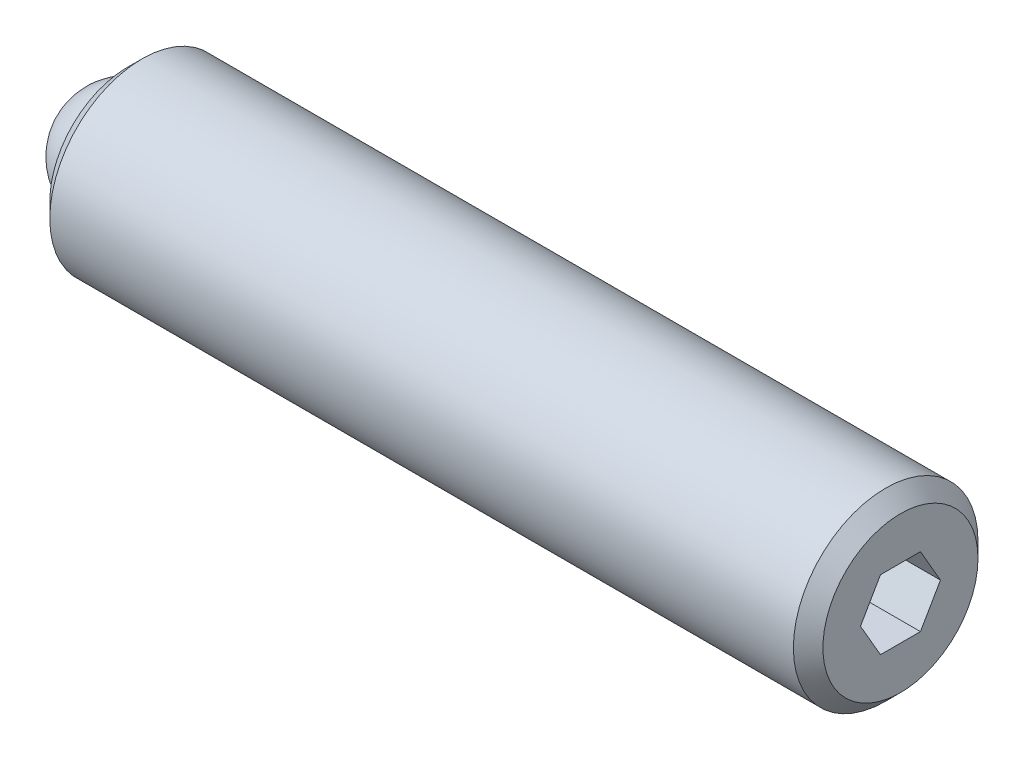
ISO-10303-21;
HEADER;
FILE_DESCRIPTION(('STEP AP214'),'2;1');
FILE_NAME('part.step','',(''),(''),'','','');
FILE_SCHEMA(('AUTOMOTIVE_DESIGN { 1 0 10303 214 1 1 1 1 }'));
ENDSEC;
DATA;
#1=APPLICATION_CONTEXT('core data for automotive mechanical design processes');
#2=APPLICATION_PROTOCOL_DEFINITION('international standard','automotive_design',2000,#1);
#3=PRODUCT_CONTEXT('',#1,'mechanical');
#4=PRODUCT('Part','Part','',(#3));
#5=PRODUCT_RELATED_PRODUCT_CATEGORY('part','',(#4));
#6=PRODUCT_DEFINITION_FORMATION('','',#4);
#7=PRODUCT_DEFINITION_CONTEXT('part definition',#1,'design');
#8=PRODUCT_DEFINITION('design','',#6,#7);
#9=PRODUCT_DEFINITION_SHAPE('','',#8);
#10=(LENGTH_UNIT() NAMED_UNIT(*) SI_UNIT(.MILLI.,.METRE.));
#11=(NAMED_UNIT(*) PLANE_ANGLE_UNIT() SI_UNIT($,.RADIAN.));
#12=(NAMED_UNIT(*) SI_UNIT($,.STERADIAN.) SOLID_ANGLE_UNIT());
#13=UNCERTAINTY_MEASURE_WITH_UNIT(LENGTH_MEASURE(1.E-05),#10,'distance_accuracy_value','');
#14=(GEOMETRIC_REPRESENTATION_CONTEXT(3) GLOBAL_UNCERTAINTY_ASSIGNED_CONTEXT((#13)) GLOBAL_UNIT_ASSIGNED_CONTEXT((#10,
#11,#12)) REPRESENTATION_CONTEXT('',''));
#15=CARTESIAN_POINT('',(0.,0.,0.));
#16=DIRECTION('',(0.,0.,1.));
#17=DIRECTION('',(1.,0.,0.));
#18=AXIS2_PLACEMENT_3D('',#15,#16,#17);
#19=CARTESIAN_POINT('',(0.,0.,0.));
#20=DIRECTION('',(0.,-1.,0.));
#21=DIRECTION('',(0.,0.,1.));
#22=AXIS2_PLACEMENT_3D('',#19,#20,#21);
#23=SPHERICAL_SURFACE('',#22,1.984375);
#24=CARTESIAN_POINT('',(0.,-1.984375,0.));
#25=VERTEX_POINT('',#24);
#26=VERTEX_LOOP('',#25);
#27=FACE_BOUND('',#26,.T.);
#28=ADVANCED_FACE('F43',(#27),#23,.T.);
#29=CLOSED_SHELL('',(#28));
#30=MANIFOLD_SOLID_BREP('B2',#29);
#31=CARTESIAN_POINT('',(26.590625,0.,0.));
#32=DIRECTION('',(-1.,0.,0.));
#33=DIRECTION('',(0.,0.,1.));
#34=AXIS2_PLACEMENT_3D('',#31,#32,#33);
#35=CYLINDRICAL_SURFACE('',#34,3.175);
#36=CARTESIAN_POINT('',(26.082625,0.,0.));
#37=DIRECTION('',(1.,0.,0.));
#38=DIRECTION('',(0.,0.,-1.));
#39=AXIS2_PLACEMENT_3D('',#36,#37,#38);
#40=CIRCLE('',#39,3.175);
#41=CARTESIAN_POINT('',(26.082625,0.,-3.175));
#42=VERTEX_POINT('',#41);
#43=EDGE_CURVE('E41',#42,#42,#40,.F.);
#44=ORIENTED_EDGE('',*,*,#43,.T.);
#45=EDGE_LOOP('',(#44));
#46=FACE_BOUND('',#45,.T.);
#47=CARTESIAN_POINT('',(0.508000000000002,0.,0.));
#48=DIRECTION('',(1.,0.,0.));
#49=DIRECTION('',(0.,0.,-1.));
#50=AXIS2_PLACEMENT_3D('',#47,#48,#49);
#51=CIRCLE('',#50,3.175);
#52=CARTESIAN_POINT('',(0.508000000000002,0.,-3.175));
#53=VERTEX_POINT('',#52);
#54=EDGE_CURVE('E159',#53,#53,#51,.T.);
#55=ORIENTED_EDGE('',*,*,#54,.T.);
#56=EDGE_LOOP('',(#55));
#57=FACE_BOUND('',#56,.T.);
#58=ADVANCED_FACE('F56',(#46,#57),#35,.T.);
#59=CARTESIAN_POINT('',(26.590625,0.,0.));
#60=DIRECTION('',(1.,0.,0.));
#61=DIRECTION('',(0.,0.,-1.));
#62=AXIS2_PLACEMENT_3D('',#59,#60,#61);
#63=PLANE('',#62);
#64=DIRECTION('',(0.,0.866025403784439,-0.5));
#65=VECTOR('',#64,1.);
#66=CARTESIAN_POINT('',(26.590625,-1.190625,-0.687407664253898));
#67=LINE('',#66,#65);
#68=CARTESIAN_POINT('',(26.590625,-1.190625,-0.687407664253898));
#69=VERTEX_POINT('',#68);
#70=CARTESIAN_POINT('',(26.590625,0.,-1.3748153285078));
#71=VERTEX_POINT('',#70);
#72=EDGE_CURVE('E71',#69,#71,#67,.T.);
#73=ORIENTED_EDGE('',*,*,#72,.F.);
#74=DIRECTION('',(0.,0.,-1.));
#75=VECTOR('',#74,1.);
#76=CARTESIAN_POINT('',(26.590625,-1.190625,0.687407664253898));
#77=LINE('',#76,#75);
#78=CARTESIAN_POINT('',(26.590625,-1.190625,0.687407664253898));
#79=VERTEX_POINT('',#78);
#80=EDGE_CURVE('E155',#79,#69,#77,.T.);
#81=ORIENTED_EDGE('',*,*,#80,.F.);
#82=DIRECTION('',(0.,-0.866025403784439,-0.5));
#83=VECTOR('',#82,1.);
#84=CARTESIAN_POINT('',(26.590625,0.,1.3748153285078));
#85=LINE('',#84,#83);
#86=CARTESIAN_POINT('',(26.590625,0.,1.3748153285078));
#87=VERTEX_POINT('',#86);
#88=EDGE_CURVE('E153',#87,#79,#85,.T.);
#89=ORIENTED_EDGE('',*,*,#88,.F.);
#90=DIRECTION('',(0.,-0.866025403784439,0.5));
#91=VECTOR('',#90,1.);
#92=CARTESIAN_POINT('',(26.590625,1.190625,0.687407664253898));
#93=LINE('',#92,#91);
#94=CARTESIAN_POINT('',(26.590625,1.190625,0.687407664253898));
#95=VERTEX_POINT('',#94);
#96=EDGE_CURVE('E119',#95,#87,#93,.T.);
#97=ORIENTED_EDGE('',*,*,#96,.F.);
#98=DIRECTION('',(0.,0.,1.));
#99=VECTOR('',#98,1.);
#100=CARTESIAN_POINT('',(26.590625,1.190625,-0.687407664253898));
#101=LINE('',#100,#99);
#102=CARTESIAN_POINT('',(26.590625,1.190625,-0.687407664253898));
#103=VERTEX_POINT('',#102);
#104=EDGE_CURVE('E149',#103,#95,#101,.T.);
#105=ORIENTED_EDGE('',*,*,#104,.F.);
#106=DIRECTION('',(0.,0.866025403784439,0.5));
#107=VECTOR('',#106,1.);
#108=CARTESIAN_POINT('',(26.590625,0.,-1.3748153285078));
#109=LINE('',#108,#107);
#110=EDGE_CURVE('E145',#71,#103,#109,.T.);
#111=ORIENTED_EDGE('',*,*,#110,.F.);
#112=EDGE_LOOP('',(#73,#81,#89,#97,#105,#111));
#113=FACE_BOUND('',#112,.T.);
#114=CARTESIAN_POINT('',(26.590625,0.,0.));
#115=DIRECTION('',(1.,0.,0.));
#116=DIRECTION('',(0.,0.,-1.));
#117=AXIS2_PLACEMENT_3D('',#114,#115,#116);
#118=CIRCLE('',#117,2.667);
#119=CARTESIAN_POINT('',(26.590625,0.,-2.667));
#120=VERTEX_POINT('',#119);
#121=EDGE_CURVE('E64',#120,#120,#118,.T.);
#122=ORIENTED_EDGE('',*,*,#121,.T.);
#123=EDGE_LOOP('',(#122));
#124=FACE_BOUND('',#123,.T.);
#125=ADVANCED_FACE('F172',(#113,#124),#63,.T.);
#126=CARTESIAN_POINT('',(0.,0.,0.));
#127=DIRECTION('',(1.,0.,0.));
#128=DIRECTION('',(0.,0.,-1.));
#129=AXIS2_PLACEMENT_3D('',#126,#127,#128);
#130=PLANE('',#129);
#131=CARTESIAN_POINT('',(0.,0.,0.));
#132=DIRECTION('',(-1.,0.,0.));
#133=DIRECTION('',(0.,0.,1.));
#134=AXIS2_PLACEMENT_3D('',#131,#132,#133);
#135=CIRCLE('',#134,1.9812);
#136=CARTESIAN_POINT('',(0.,0.,1.9812));
#137=VERTEX_POINT('',#136);
#138=EDGE_CURVE('E227',#137,#137,#135,.T.);
#139=ORIENTED_EDGE('',*,*,#138,.F.);
#140=EDGE_LOOP('',(#139));
#141=FACE_BOUND('',#140,.T.);
#142=CARTESIAN_POINT('',(0.,0.,0.));
#143=DIRECTION('',(1.,0.,0.));
#144=DIRECTION('',(0.,0.,-1.));
#145=AXIS2_PLACEMENT_3D('',#142,#143,#144);
#146=CIRCLE('',#145,2.667);
#147=CARTESIAN_POINT('',(0.,0.,-2.667));
#148=VERTEX_POINT('',#147);
#149=EDGE_CURVE('E167',#148,#148,#146,.F.);
#150=ORIENTED_EDGE('',*,*,#149,.T.);
#151=EDGE_LOOP('',(#150));
#152=FACE_BOUND('',#151,.T.);
#153=ADVANCED_FACE('F184',(#141,#152),#130,.F.);
#154=CARTESIAN_POINT('',(0.508000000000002,0.,0.));
#155=DIRECTION('',(1.,0.,0.));
#156=DIRECTION('',(0.,0.,-1.));
#157=AXIS2_PLACEMENT_3D('',#154,#155,#156);
#158=CONICAL_SURFACE('',#157,3.175,0.785398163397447);
#159=ORIENTED_EDGE('',*,*,#149,.F.);
#160=EDGE_LOOP('',(#159));
#161=FACE_BOUND('',#160,.T.);
#162=ORIENTED_EDGE('',*,*,#54,.F.);
#163=EDGE_LOOP('',(#162));
#164=FACE_BOUND('',#163,.T.);
#165=ADVANCED_FACE('F176',(#161,#164),#158,.T.);
#166=CARTESIAN_POINT('',(26.590625,0.,0.));
#167=DIRECTION('',(-1.,0.,0.));
#168=DIRECTION('',(0.,0.,1.));
#169=AXIS2_PLACEMENT_3D('',#166,#167,#168);
#170=CONICAL_SURFACE('',#169,2.667,0.785398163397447);
#171=ORIENTED_EDGE('',*,*,#43,.F.);
#172=EDGE_LOOP('',(#171));
#173=FACE_BOUND('',#172,.T.);
#174=ORIENTED_EDGE('',*,*,#121,.F.);
#175=EDGE_LOOP('',(#174));
#176=FACE_BOUND('',#175,.T.);
#177=ADVANCED_FACE('F58',(#173,#176),#170,.T.);
#178=CARTESIAN_POINT('',(24.304625,-1.190625,-0.687407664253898));
#179=DIRECTION('',(0.,-0.5,-0.866025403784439));
#180=DIRECTION('',(0.,0.866025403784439,-0.5));
#181=AXIS2_PLACEMENT_3D('',#178,#179,#180);
#182=PLANE('',#181);
#183=ORIENTED_EDGE('',*,*,#72,.T.);
#184=DIRECTION('',(1.,0.,0.));
#185=VECTOR('',#184,1.);
#186=CARTESIAN_POINT('',(24.304625,0.,-1.3748153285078));
#187=LINE('',#186,#185);
#188=CARTESIAN_POINT('',(24.304625,0.,-1.3748153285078));
#189=VERTEX_POINT('',#188);
#190=EDGE_CURVE('E101',#189,#71,#187,.T.);
#191=ORIENTED_EDGE('',*,*,#190,.F.);
#192=DIRECTION('',(0.,0.866025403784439,-0.5));
#193=VECTOR('',#192,1.);
#194=CARTESIAN_POINT('',(24.304625,-1.190625,-0.687407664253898));
#195=LINE('',#194,#193);
#196=CARTESIAN_POINT('',(24.304625,-1.190625,-0.687407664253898));
#197=VERTEX_POINT('',#196);
#198=EDGE_CURVE('E157',#197,#189,#195,.T.);
#199=ORIENTED_EDGE('',*,*,#198,.F.);
#200=DIRECTION('',(1.,0.,0.));
#201=VECTOR('',#200,1.);
#202=CARTESIAN_POINT('',(24.304625,-1.190625,-0.687407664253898));
#203=LINE('',#202,#201);
#204=EDGE_CURVE('E79',#197,#69,#203,.T.);
#205=ORIENTED_EDGE('',*,*,#204,.T.);
#206=EDGE_LOOP('',(#183,#191,#199,#205));
#207=FACE_BOUND('',#206,.T.);
#208=ADVANCED_FACE('F175',(#207),#182,.F.);
#209=CARTESIAN_POINT('',(24.304625,-1.190625,0.687407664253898));
#210=DIRECTION('',(0.,-1.,0.));
#211=DIRECTION('',(0.,0.,-1.));
#212=AXIS2_PLACEMENT_3D('',#209,#210,#211);
#213=PLANE('',#212);
#214=ORIENTED_EDGE('',*,*,#80,.T.);
#215=ORIENTED_EDGE('',*,*,#204,.F.);
#216=DIRECTION('',(0.,0.,-1.));
#217=VECTOR('',#216,1.);
#218=CARTESIAN_POINT('',(24.304625,-1.190625,0.687407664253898));
#219=LINE('',#218,#217);
#220=CARTESIAN_POINT('',(24.304625,-1.190625,0.687407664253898));
#221=VERTEX_POINT('',#220);
#222=EDGE_CURVE('E131',#221,#197,#219,.T.);
#223=ORIENTED_EDGE('',*,*,#222,.F.);
#224=DIRECTION('',(1.,0.,0.));
#225=VECTOR('',#224,1.);
#226=CARTESIAN_POINT('',(24.304625,-1.190625,0.687407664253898));
#227=LINE('',#226,#225);
#228=EDGE_CURVE('E123',#221,#79,#227,.T.);
#229=ORIENTED_EDGE('',*,*,#228,.T.);
#230=EDGE_LOOP('',(#214,#215,#223,#229));
#231=FACE_BOUND('',#230,.T.);
#232=ADVANCED_FACE('F182',(#231),#213,.F.);
#233=CARTESIAN_POINT('',(24.304625,0.,1.3748153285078));
#234=DIRECTION('',(0.,-0.5,0.866025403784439));
#235=DIRECTION('',(0.,-0.866025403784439,-0.5));
#236=AXIS2_PLACEMENT_3D('',#233,#234,#235);
#237=PLANE('',#236);
#238=ORIENTED_EDGE('',*,*,#88,.T.);
#239=ORIENTED_EDGE('',*,*,#228,.F.);
#240=DIRECTION('',(0.,-0.866025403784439,-0.5));
#241=VECTOR('',#240,1.);
#242=CARTESIAN_POINT('',(24.304625,0.,1.3748153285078));
#243=LINE('',#242,#241);
#244=CARTESIAN_POINT('',(24.304625,0.,1.3748153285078));
#245=VERTEX_POINT('',#244);
#246=EDGE_CURVE('E127',#245,#221,#243,.T.);
#247=ORIENTED_EDGE('',*,*,#246,.F.);
#248=DIRECTION('',(1.,0.,0.));
#249=VECTOR('',#248,1.);
#250=CARTESIAN_POINT('',(24.304625,0.,1.3748153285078));
#251=LINE('',#250,#249);
#252=EDGE_CURVE('E112',#245,#87,#251,.T.);
#253=ORIENTED_EDGE('',*,*,#252,.T.);
#254=EDGE_LOOP('',(#238,#239,#247,#253));
#255=FACE_BOUND('',#254,.T.);
#256=ADVANCED_FACE('F128',(#255),#237,.F.);
#257=CARTESIAN_POINT('',(24.304625,1.190625,0.687407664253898));
#258=DIRECTION('',(0.,0.5,0.866025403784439));
#259=DIRECTION('',(0.,-0.866025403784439,0.5));
#260=AXIS2_PLACEMENT_3D('',#257,#258,#259);
#261=PLANE('',#260);
#262=ORIENTED_EDGE('',*,*,#96,.T.);
#263=ORIENTED_EDGE('',*,*,#252,.F.);
#264=DIRECTION('',(0.,-0.866025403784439,0.5));
#265=VECTOR('',#264,1.);
#266=CARTESIAN_POINT('',(24.304625,1.190625,0.687407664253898));
#267=LINE('',#266,#265);
#268=CARTESIAN_POINT('',(24.304625,1.190625,0.687407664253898));
#269=VERTEX_POINT('',#268);
#270=EDGE_CURVE('E116',#269,#245,#267,.T.);
#271=ORIENTED_EDGE('',*,*,#270,.F.);
#272=DIRECTION('',(1.,0.,0.));
#273=VECTOR('',#272,1.);
#274=CARTESIAN_POINT('',(24.304625,1.190625,0.687407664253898));
#275=LINE('',#274,#273);
#276=EDGE_CURVE('E124',#269,#95,#275,.T.);
#277=ORIENTED_EDGE('',*,*,#276,.T.);
#278=EDGE_LOOP('',(#262,#263,#271,#277));
#279=FACE_BOUND('',#278,.T.);
#280=ADVANCED_FACE('F114',(#279),#261,.F.);
#281=CARTESIAN_POINT('',(24.304625,1.190625,-0.687407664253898));
#282=DIRECTION('',(0.,1.,0.));
#283=DIRECTION('',(0.,0.,1.));
#284=AXIS2_PLACEMENT_3D('',#281,#282,#283);
#285=PLANE('',#284);
#286=ORIENTED_EDGE('',*,*,#104,.T.);
#287=ORIENTED_EDGE('',*,*,#276,.F.);
#288=DIRECTION('',(0.,0.,1.));
#289=VECTOR('',#288,1.);
#290=CARTESIAN_POINT('',(24.304625,1.190625,-0.687407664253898));
#291=LINE('',#290,#289);
#292=CARTESIAN_POINT('',(24.304625,1.190625,-0.687407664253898));
#293=VERTEX_POINT('',#292);
#294=EDGE_CURVE('E137',#293,#269,#291,.T.);
#295=ORIENTED_EDGE('',*,*,#294,.F.);
#296=DIRECTION('',(1.,0.,0.));
#297=VECTOR('',#296,1.);
#298=CARTESIAN_POINT('',(24.304625,1.190625,-0.687407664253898));
#299=LINE('',#298,#297);
#300=EDGE_CURVE('E162',#293,#103,#299,.T.);
#301=ORIENTED_EDGE('',*,*,#300,.T.);
#302=EDGE_LOOP('',(#286,#287,#295,#301));
#303=FACE_BOUND('',#302,.T.);
#304=ADVANCED_FACE('F203',(#303),#285,.F.);
#305=CARTESIAN_POINT('',(24.304625,0.,-1.3748153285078));
#306=DIRECTION('',(0.,0.5,-0.866025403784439));
#307=DIRECTION('',(0.,0.866025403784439,0.5));
#308=AXIS2_PLACEMENT_3D('',#305,#306,#307);
#309=PLANE('',#308);
#310=ORIENTED_EDGE('',*,*,#110,.T.);
#311=ORIENTED_EDGE('',*,*,#300,.F.);
#312=DIRECTION('',(0.,0.866025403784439,0.5));
#313=VECTOR('',#312,1.);
#314=CARTESIAN_POINT('',(24.304625,0.,-1.3748153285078));
#315=LINE('',#314,#313);
#316=EDGE_CURVE('E139',#189,#293,#315,.T.);
#317=ORIENTED_EDGE('',*,*,#316,.F.);
#318=ORIENTED_EDGE('',*,*,#190,.T.);
#319=EDGE_LOOP('',(#310,#311,#317,#318));
#320=FACE_BOUND('',#319,.T.);
#321=ADVANCED_FACE('F200',(#320),#309,.F.);
#322=CARTESIAN_POINT('',(24.304625,0.,0.));
#323=DIRECTION('',(1.,0.,0.));
#324=DIRECTION('',(0.,0.,-1.));
#325=AXIS2_PLACEMENT_3D('',#322,#323,#324);
#326=PLANE('',#325);
#327=ORIENTED_EDGE('',*,*,#198,.T.);
#328=ORIENTED_EDGE('',*,*,#316,.T.);
#329=ORIENTED_EDGE('',*,*,#294,.T.);
#330=ORIENTED_EDGE('',*,*,#270,.T.);
#331=ORIENTED_EDGE('',*,*,#246,.T.);
#332=ORIENTED_EDGE('',*,*,#222,.T.);
#333=EDGE_LOOP('',(#327,#328,#329,#330,#331,#332));
#334=FACE_BOUND('',#333,.T.);
#335=ADVANCED_FACE('F134',(#334),#326,.T.);
#336=CARTESIAN_POINT('',(1.984375,0.,0.));
#337=DIRECTION('',(-1.,0.,0.));
#338=DIRECTION('',(0.,0.,1.));
#339=AXIS2_PLACEMENT_3D('',#336,#337,#338);
#340=CYLINDRICAL_SURFACE('',#339,1.9812);
#341=CARTESIAN_POINT('',(1.984375,0.,0.));
#342=DIRECTION('',(-1.,0.,0.));
#343=DIRECTION('',(0.,0.,1.));
#344=AXIS2_PLACEMENT_3D('',#341,#342,#343);
#345=CIRCLE('',#344,1.9812);
#346=CARTESIAN_POINT('',(1.984375,0.,1.9812));
#347=VERTEX_POINT('',#346);
#348=EDGE_CURVE('E146',#347,#347,#345,.T.);
#349=ORIENTED_EDGE('',*,*,#348,.F.);
#350=EDGE_LOOP('',(#349));
#351=FACE_BOUND('',#350,.T.);
#352=ORIENTED_EDGE('',*,*,#138,.T.);
#353=EDGE_LOOP('',(#352));
#354=FACE_BOUND('',#353,.T.);
#355=ADVANCED_FACE('F216',(#351,#354),#340,.F.);
#356=CARTESIAN_POINT('',(1.984375,0.,0.));
#357=DIRECTION('',(-1.,0.,0.));
#358=DIRECTION('',(0.,0.,1.));
#359=AXIS2_PLACEMENT_3D('',#356,#357,#358);
#360=PLANE('',#359);
#361=ORIENTED_EDGE('',*,*,#348,.T.);
#362=EDGE_LOOP('',(#361));
#363=FACE_BOUND('',#362,.T.);
#364=ADVANCED_FACE('F219',(#363),#360,.T.);
#365=CLOSED_SHELL('',(#58,#125,#153,#165,#177,#208,#232,#256,#280,#304,#321,#335,#355,#364));
#366=MANIFOLD_SOLID_BREP('B6',#365);
#367=ADVANCED_BREP_SHAPE_REPRESENTATION('',(#18,#30,#366),#14);
#368=SHAPE_DEFINITION_REPRESENTATION(#9,#367);
ENDSEC;
END-ISO-10303-21;
